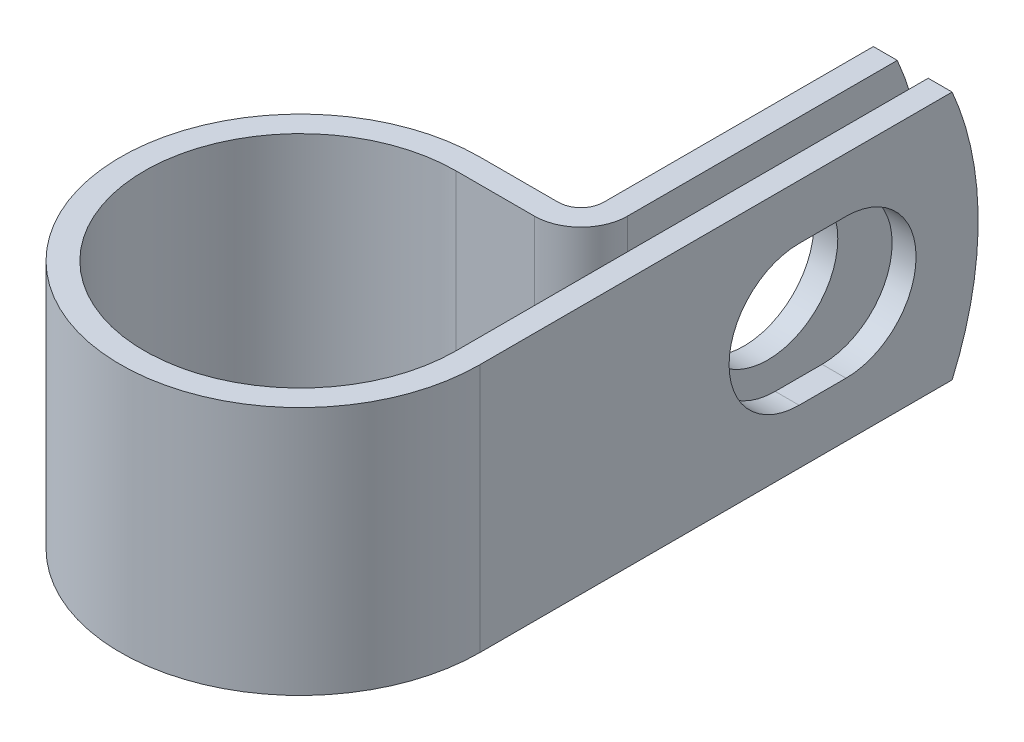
from build123d import *

# Parameters (mm, degrees)
EXTRUDE_THIN1_DEPTH = 6.35
SKETCH2_R           = 3.5687
CUT_EXTRUDE1_DEPTH  = 1.2192
CUT_EXTRUDE2_REACH  = 33.931
CUT_EXTRUDE3_DEPTH  = 30.810879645


with BuildPart() as part:
    # Sketch1 → Extrude-Thin1 (new, symmetric)
    with BuildSketch(Plane(origin=(0, 0, 0), x_dir=(1, 0, 0), z_dir=(0, 1, 0))):
        with BuildLine():
            Line((7.9375, 25.3746), (7.9375, 7.9375))
            Line((7.9375, 7.9375), (7.9375, 0))
            ThreePointArc((7.9375, 0), (-5.612660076, -5.612660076), (0, 7.9375))
            Line((0, 7.9375), (3.98526, 7.9375))
            ThreePointArc((3.98526, 7.9375), (5.666363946, 8.633836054), (6.3627, 10.31494))
            Line((6.3627, 10.31494), (6.3627, 25.3746))
            Line((6.3627, 25.3746), (5.1435, 25.3746))
            Line((5.1435, 25.3746), (5.1435, 10.31494))
            ThreePointArc((5.1435, 10.31494), (4.804259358, 9.495940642), (3.98526, 9.1567))
            Line((3.98526, 9.1567), (0, 9.1567))
            ThreePointArc((0, 9.1567), (-6.474764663, -6.474764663), (9.1567, 0))
            Line((9.1567, 0), (9.1567, 7.9375))
            Line((9.1567, 7.9375), (9.1567, 25.3746))
            Line((9.1567, 25.3746), (7.9375, 25.3746))
        make_face()
    extrude(amount=EXTRUDE_THIN1_DEPTH, both=True)

    # Sketch2 → Cut-Extrude1 (cut)
    with BuildSketch(Plane.ZY.offset(-5.1435)):
        with Locations((-17.4498, 0)):
            Circle(SKETCH2_R)
    extrude(amount=-CUT_EXTRUDE1_DEPTH, mode=Mode.SUBTRACT)

    # Sketch3 → Cut-Extrude2 (cut, up to next)
    with BuildSketch(Plane(origin=(9.1567, 0, 0), x_dir=(0, 0, -1), z_dir=(1, 0, 0)), mode=Mode.PRIVATE) as cut_extrude2_sk1:
        with BuildLine():
            Line((16.256, 3.5687), (18.6436, 3.5687))
            ThreePointArc((18.6436, 3.5687), (22.2123, 0), (18.6436, -3.5687))
            Line((18.6436, -3.5687), (16.256, -3.5687))
            ThreePointArc((16.256, -3.5687), (12.6873, 0), (16.256, 3.5687))
        make_face()
    cut_extrude2_tool1 = extrude(cut_extrude2_sk1.sketch, amount=-CUT_EXTRUDE2_REACH, mode=Mode.PRIVATE) & part.part
    add(cut_extrude2_tool1.solids().sort_by_distance((9.1567, 0, -17.4498))[0], mode=Mode.SUBTRACT)

    # Sketch4 → Cut-Extrude3 (cut, through all)
    with BuildSketch(Plane.ZY.offset(-5.1435)):
        with BuildLine():
            Line((-24.049277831, 6.35), (-25.3746, 6.35))
            Line((-25.3746, 6.35), (-25.3746, -2.1e-08))
            ThreePointArc((-25.3746, -2.1e-08), (-25.03973772, 3.243415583), (-24.049277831, 6.35))
        make_face()
        with BuildLine():
            ThreePointArc((-24.049277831, -6.35), (-25.039737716, -3.243415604), (-25.3746, -2.1e-08))
            Line((-25.3746, -2.1e-08), (-25.3746, -6.35))
            Line((-25.3746, -6.35), (-24.049277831, -6.35))
        make_face()
    extrude(amount=-CUT_EXTRUDE3_DEPTH, mode=Mode.SUBTRACT)


solid = part.part
